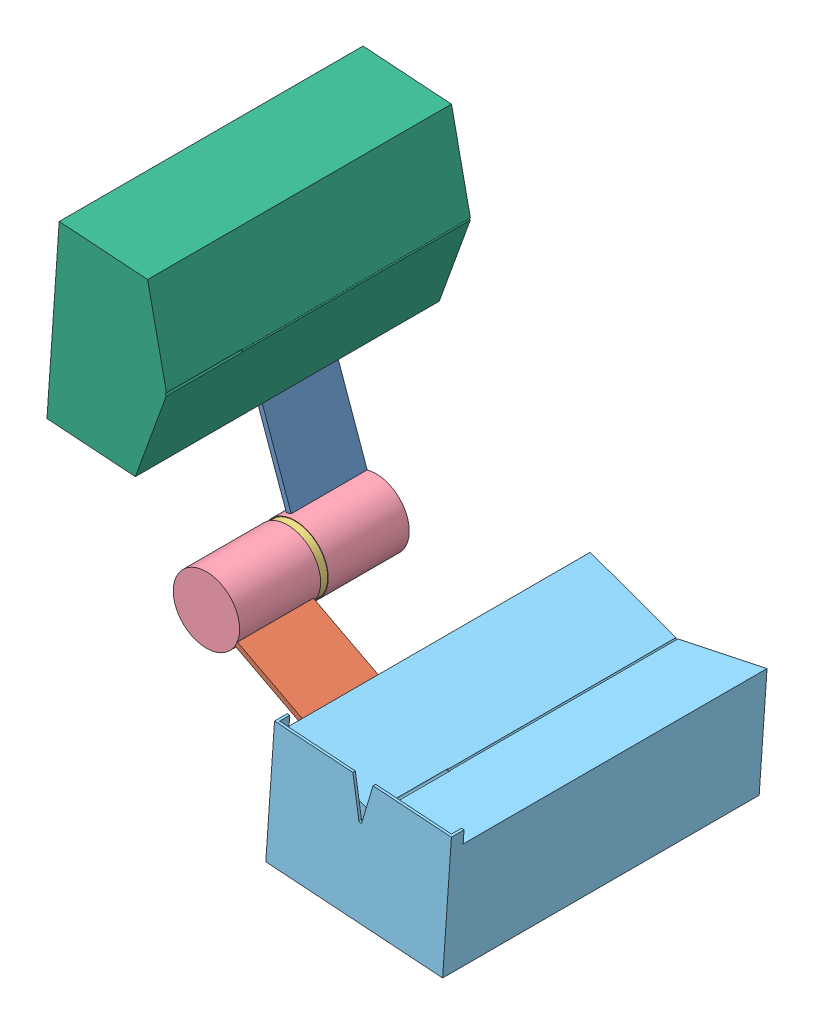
SolidWorks assembly Montagem1.SLDASM, configuration Valor predeterminado (file format 9000). Lengths in mm.
Overall size (164.7 178.03 125).
7 component instances, 6 part files, 16 mates.
Components (placement in the parent):
- chapa1-1: chapa1.SLDPRT [Valor predeterminado] at (-58.1191 20.1516 37.0526) x (0.069059 0.997613 0) z (0 0 1) size (45.83 21.83 30)
- chapa2-1: chapa2.SLDPRT [Valor predeterminado] at (-12.7337 -34.2515 74.0526) x (0.997613 -0.069059 0) z (0 0 1) size (45.83 21.83 30)
- pino-1: pino.SLDPRT [Valor predeterminado] at (-46.2125 -16.0524 38.0526) x (-0.168404 0.985718 0) z (0 0 1) size (25.4 25.4 65)
- capapino-1: capapino.SLDPRT [Valor predeterminado] at (-46.2125 -16.0524 38.0526) x (0.158903 -0.987294 0) z (0 0 1) size (26.2 26.2 32)
- capapino-2: capapino.SLDPRT [Valor predeterminado] at (-46.2125 -16.0524 103.0526) x (-0.069059 -0.997613 0) z (0 0 -1) size (26.2 26.2 32)
- Recarga2-1: Recarga2.SLDPRT [Valor predeterminado] at (44.9797 -39.1351 10.3287) x (0.997613 -0.069059 0) z (0 0 1) size (70 50 125)
- recarga_cima-1: recarga_cima.SLDPRT [Valor predeterminado] at (-58.0462 77.557 10.3287) x (0.069059 0.997613 0) z (0 0 1) size (70 44.89 120)
Mates (geometry in assembly coordinates):
- Tangente5: tangent anti-aligned: plane of chapa2-1 through (-34.9013 -22.6931 104.0526) normal (-0.886703 0.462339 0); cylinder of capapino-2 through (-46.2125 -16.0524 72.0526) axis (0 0 1) radius 13.1
- Coincidente6: coincident aligned: plane of chapa2-1 through (-12.7337 -34.2515 104.0526) normal (0 0 1); plane of capapino-2 through (-46.2125 -16.0524 104.0526) normal (0 0 1)
- Bloquear3: lock: unknown of chapa2-1; unknown of capapino-2
- Tangente6: tangent anti-aligned: plane of chapa1-1 through (-49.7253 -3.3971 67.0526) normal (0.335751 -0.941951 0); cylinder of capapino-1 through (-46.2125 -16.0524 69.0526) axis (0 0 -1) radius 13.1
- Coincidente7: coincident aligned: plane of chapa1-1 through (-58.1191 20.1516 37.0526) normal (0 0 -1); plane of capapino-1 through (-46.2125 -16.0524 37.0526) normal (0 0 -1)
- Bloquear4: lock: unknown of chapa1-1; unknown of capapino-1
- Concêntrico4: concentric anti-aligned: circle of pino-1; circle of capapino-1
- Concêntrico5: concentric aligned: circle of pino-1; circle of capapino-2
- Coincidente10: coincident anti-aligned: plane of pino-1 through (-46.2125 -16.0524 38.0526) normal (0 0 -1); plane of capapino-1 through (-46.2125 -16.0524 38.0526) normal (0 0 1)
- Coincidente11: coincident anti-aligned: plane of pino-1 through (-46.2125 -16.0524 103.0526) normal (0 0 1); plane of capapino-2 through (-46.2125 -16.0524 103.0526) normal (0 0 -1)
- Coincidente13: coincident anti-aligned: plane of chapa2-1 through (9.4339 -45.81 104.0526) normal (0.997613 -0.069059 0); plane of Recarga2-1 through (8.5094 -59.1643 130.3287) normal (-0.997613 0.069059 0)
- Bloquear6: lock: unknown of chapa2-1; unknown of Recarga2-1
- Simétrico1: symmetric aligned: plane of Recarga2-1 through (45.843 -26.665 10.3287) normal (0 0 -1); plane of recarga_cima-1 through (-35.5999 76.0031 10.3287) normal (0 0 -1); plane of recarga_cima-1 through (-47.9931 41.7773 130.3287) normal (-0.069059 -0.997613 0)
- Paralelo4: parallel anti-aligned: plane of chapa1-1 through (-68.3968 43.0289 67.0526) normal (0.069059 0.997613 0); plane of recarga_cima-1 through (-47.9931 41.7773 130.3287) normal (-0.069059 -0.997613 0)
- Bloquear8: lock: unknown of chapa1-1; unknown of recarga_cima-1
- ÂnguloLimite3: limit planar angle = 1.570796 rad aligned: plane of recarga_cima-1 through (-47.9931 41.7773 130.3287) normal (-0.069059 -0.997613 0); plane of Recarga2-1 through (8.5094 -59.1643 130.3287) normal (-0.997613 0.069059 0)
